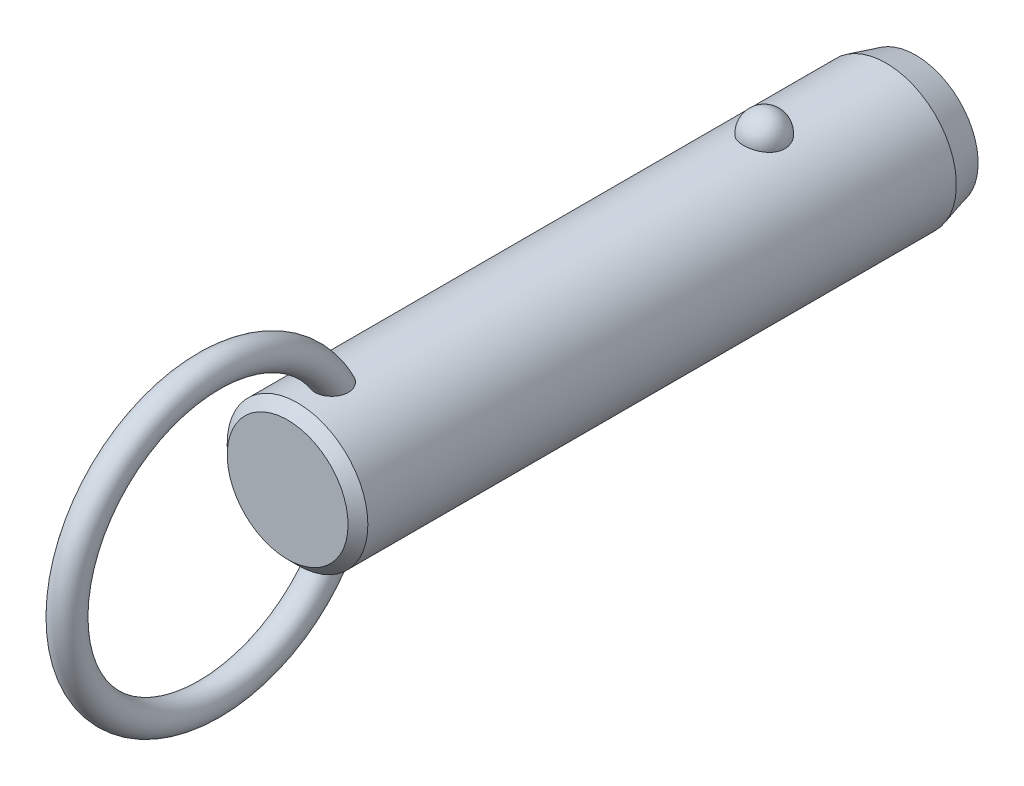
ISO-10303-21;
HEADER;
FILE_DESCRIPTION(('STEP AP214'),'2;1');
FILE_NAME('part.step','',(''),(''),'','','');
FILE_SCHEMA(('AUTOMOTIVE_DESIGN { 1 0 10303 214 1 1 1 1 }'));
ENDSEC;
DATA;
#1=APPLICATION_CONTEXT('core data for automotive mechanical design processes');
#2=APPLICATION_PROTOCOL_DEFINITION('international standard','automotive_design',2000,#1);
#3=PRODUCT_CONTEXT('',#1,'mechanical');
#4=PRODUCT('Part','Part','',(#3));
#5=PRODUCT_RELATED_PRODUCT_CATEGORY('part','',(#4));
#6=PRODUCT_DEFINITION_FORMATION('','',#4);
#7=PRODUCT_DEFINITION_CONTEXT('part definition',#1,'design');
#8=PRODUCT_DEFINITION('design','',#6,#7);
#9=PRODUCT_DEFINITION_SHAPE('','',#8);
#10=(LENGTH_UNIT() NAMED_UNIT(*) SI_UNIT(.MILLI.,.METRE.));
#11=(NAMED_UNIT(*) PLANE_ANGLE_UNIT() SI_UNIT($,.RADIAN.));
#12=(NAMED_UNIT(*) SI_UNIT($,.STERADIAN.) SOLID_ANGLE_UNIT());
#13=UNCERTAINTY_MEASURE_WITH_UNIT(LENGTH_MEASURE(1.E-05),#10,'distance_accuracy_value','');
#14=(GEOMETRIC_REPRESENTATION_CONTEXT(3) GLOBAL_UNCERTAINTY_ASSIGNED_CONTEXT((#13)) GLOBAL_UNIT_ASSIGNED_CONTEXT((#10,
#11,#12)) REPRESENTATION_CONTEXT('',''));
#15=CARTESIAN_POINT('',(0.,0.,0.));
#16=DIRECTION('',(0.,0.,1.));
#17=DIRECTION('',(1.,0.,0.));
#18=AXIS2_PLACEMENT_3D('',#15,#16,#17);
#19=CARTESIAN_POINT('',(0.,0.,38.1));
#20=DIRECTION('',(0.,0.,-1.));
#21=DIRECTION('',(-1.,0.,0.));
#22=AXIS2_PLACEMENT_3D('',#19,#20,#21);
#23=CYLINDRICAL_SURFACE('',#22,7.1);
#24=CARTESIAN_POINT('',(2.0769088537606,6.78943661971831,-2.1));
#25=CARTESIAN_POINT('',(2.07690739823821,6.78943796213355,-1.98268154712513));
#26=CARTESIAN_POINT('',(2.06738130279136,6.79237331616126,-1.86534506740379));
#27=CARTESIAN_POINT('',(2.0295040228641,6.8037853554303,-1.63400788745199));
#28=CARTESIAN_POINT('',(2.00114757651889,6.81226358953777,-1.52000812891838));
#29=CARTESIAN_POINT('',(1.92632025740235,6.83379798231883,-1.29863433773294));
#30=CARTESIAN_POINT('',(1.87985726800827,6.84685214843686,-1.19125744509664));
#31=CARTESIAN_POINT('',(1.76995205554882,6.87608091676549,-0.986046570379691));
#32=CARTESIAN_POINT('',(1.70650980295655,6.8922555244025,-0.888212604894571));
#33=CARTESIAN_POINT('',(1.56381192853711,6.92602930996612,-0.704242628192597));
#34=CARTESIAN_POINT('',(1.4844714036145,6.94363582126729,-0.618173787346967));
#35=CARTESIAN_POINT('',(1.31221746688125,6.97823658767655,-0.460740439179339));
#36=CARTESIAN_POINT('',(1.21930409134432,6.99523084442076,-0.389375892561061));
#37=CARTESIAN_POINT('',(1.02268781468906,7.02666176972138,-0.263547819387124));
#38=CARTESIAN_POINT('',(0.919020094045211,7.04110638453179,-0.209031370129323));
#39=CARTESIAN_POINT('',(0.703548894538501,7.06588726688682,-0.118163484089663));
#40=CARTESIAN_POINT('',(0.591746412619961,7.07622403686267,-0.081809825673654));
#41=CARTESIAN_POINT('',(0.365557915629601,7.09147068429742,-0.0288711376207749));
#42=CARTESIAN_POINT('',(0.251267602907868,7.09648447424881,-0.0119070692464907));
#43=CARTESIAN_POINT('',(0.0213499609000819,7.10089837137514,0.00304925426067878));
#44=CARTESIAN_POINT('',(-0.0942772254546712,7.10029907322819,0.00104351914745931));
#45=CARTESIAN_POINT('',(-0.321651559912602,7.09360829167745,-0.0216931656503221));
#46=CARTESIAN_POINT('',(-0.433431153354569,7.08760388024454,-0.0421272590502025));
#47=CARTESIAN_POINT('',(-0.651862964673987,7.07086131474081,-0.100729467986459));
#48=CARTESIAN_POINT('',(-0.758515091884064,7.06012307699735,-0.138897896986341));
#49=CARTESIAN_POINT('',(-0.96444924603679,7.03496097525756,-0.232213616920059));
#50=CARTESIAN_POINT('',(-1.06368095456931,7.02051445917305,-0.287465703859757));
#51=CARTESIAN_POINT('',(-1.25145353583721,6.98948740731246,-0.413383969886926));
#52=CARTESIAN_POINT('',(-1.33999321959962,6.97290663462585,-0.48405186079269));
#53=CARTESIAN_POINT('',(-1.50591604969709,6.93898770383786,-0.640594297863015));
#54=CARTESIAN_POINT('',(-1.58302488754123,6.92164094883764,-0.72675782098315));
#55=CARTESIAN_POINT('',(-1.72189320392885,6.8884103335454,-0.910927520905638));
#56=CARTESIAN_POINT('',(-1.78365144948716,6.87252659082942,-1.008934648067));
#57=CARTESIAN_POINT('',(-1.89101272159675,6.84377189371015,-1.21549497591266));
#58=CARTESIAN_POINT('',(-1.93639553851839,6.83094274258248,-1.32416860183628));
#59=CARTESIAN_POINT('',(-2.00874275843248,6.81002070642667,-1.54791500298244));
#60=CARTESIAN_POINT('',(-2.03570774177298,6.80192767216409,-1.66298757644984));
#61=CARTESIAN_POINT('',(-2.07047276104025,6.7914266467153,-1.89571453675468));
#62=CARTESIAN_POINT('',(-2.07835878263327,6.78899315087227,-2.01335491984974));
#63=CARTESIAN_POINT('',(-2.07502083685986,6.79001409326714,-2.24833570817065));
#64=CARTESIAN_POINT('',(-2.06379746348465,6.7934683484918,-2.36567612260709));
#65=CARTESIAN_POINT('',(-2.02263913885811,6.80583442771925,-2.59603194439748));
#66=CARTESIAN_POINT('',(-1.99281127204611,6.81471501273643,-2.70906820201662));
#67=CARTESIAN_POINT('',(-1.91526639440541,6.83691232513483,-2.92836575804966));
#68=CARTESIAN_POINT('',(-1.8675486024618,6.85022924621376,-3.03462676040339));
#69=CARTESIAN_POINT('',(-1.75504492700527,6.87991336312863,-3.23806487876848));
#70=CARTESIAN_POINT('',(-1.69015924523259,6.89629822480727,-3.33518422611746));
#71=CARTESIAN_POINT('',(-1.54505404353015,6.93024852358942,-3.51697105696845));
#72=CARTESIAN_POINT('',(-1.46483385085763,6.94781401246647,-3.60163799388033));
#73=CARTESIAN_POINT('',(-1.29071406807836,6.98225977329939,-3.75654119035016));
#74=CARTESIAN_POINT('',(-1.19675650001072,6.99913673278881,-3.82671308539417));
#75=CARTESIAN_POINT('',(-0.997940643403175,7.03023618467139,-3.9501837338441));
#76=CARTESIAN_POINT('',(-0.893083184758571,7.04445887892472,-4.00348377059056));
#77=CARTESIAN_POINT('',(-0.676902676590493,7.06848365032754,-4.09107242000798));
#78=CARTESIAN_POINT('',(-0.565686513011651,7.0783430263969,-4.12560889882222));
#79=CARTESIAN_POINT('',(-0.33873982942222,7.09282534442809,-4.17575450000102));
#80=CARTESIAN_POINT('',(-0.223009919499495,7.09744899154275,-4.19136617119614));
#81=CARTESIAN_POINT('',(0.00707628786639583,7.10090930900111,-4.20307965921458));
#82=CARTESIAN_POINT('',(0.121410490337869,7.09986531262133,-4.19958377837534));
#83=CARTESIAN_POINT('',(0.347815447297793,7.092380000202,-4.17411564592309));
#84=CARTESIAN_POINT('',(0.459886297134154,7.08593891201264,-4.15214417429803));
#85=CARTESIAN_POINT('',(0.678084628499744,7.06838983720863,-4.09049562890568));
#86=CARTESIAN_POINT('',(0.784237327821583,7.05730369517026,-4.05090137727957));
#87=CARTESIAN_POINT('',(0.988305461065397,7.03163139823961,-3.95511447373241));
#88=CARTESIAN_POINT('',(1.08622031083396,7.01704499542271,-3.89892064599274));
#89=CARTESIAN_POINT('',(1.27284490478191,6.98562668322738,-3.77035541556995));
#90=CARTESIAN_POINT('',(1.36137372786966,6.96876135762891,-3.69772964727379));
#91=CARTESIAN_POINT('',(1.52509486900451,6.93477412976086,-3.53878279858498));
#92=CARTESIAN_POINT('',(1.60028496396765,6.91765218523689,-3.45245943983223));
#93=CARTESIAN_POINT('',(1.73681688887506,6.88465753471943,-3.26658774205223));
#94=CARTESIAN_POINT('',(1.79785966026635,6.86881574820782,-3.16681408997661));
#95=CARTESIAN_POINT('',(1.90265327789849,6.84053157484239,-2.95814408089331));
#96=CARTESIAN_POINT('',(1.94640861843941,6.82808830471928,-2.84925010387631));
#97=CARTESIAN_POINT('',(2.01274378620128,6.80881460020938,-2.63454318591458));
#98=CARTESIAN_POINT('',(2.03676193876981,6.80160856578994,-2.52920574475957));
#99=CARTESIAN_POINT('',(2.06884490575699,6.79191902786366,-2.3159172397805));
#100=CARTESIAN_POINT('',(2.07691019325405,6.78943538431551,-2.20796625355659));
#101=CARTESIAN_POINT('',(2.0769088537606,6.78943661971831,-2.1));
#102=B_SPLINE_CURVE_WITH_KNOTS('',3,(#24,#25,#26,#27,#28,#29,#30,#31,#32,#33,#34,#35,#36,#37,
#38,#39,#40,#41,#42,#43,#44,#45,#46,#47,#48,#49,#50,#51,#52,#53,#54,#55,#56,#57,#58,#59,#60,#61,
#62,#63,#64,#65,#66,#67,#68,#69,#70,#71,#72,#73,#74,#75,#76,#77,#78,#79,#80,#81,#82,#83,#84,#85,
#86,#87,#88,#89,#90,#91,#92,#93,#94,#95,#96,#97,#98,#99,#100,#101),.UNSPECIFIED.,.T.,.F.,(4,2,2,
2,2,2,2,2,2,2,2,2,2,2,2,2,2,2,2,2,2,2,2,2,2,2,2,2,2,2,2,2,2,2,2,2,2,2,4),(0.,0.351568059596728,
0.703234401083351,1.05474780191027,1.40626181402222,1.75970563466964,2.11314851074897,
2.4654696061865,2.81774759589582,3.16301449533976,3.50824481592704,3.84801136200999,
4.18778391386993,4.52968352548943,4.87162112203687,5.22076181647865,5.56993054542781,
5.92363364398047,6.27732559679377,6.62942052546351,6.98150450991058,7.33158042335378,
7.68167162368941,8.03384443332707,8.38603269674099,8.73975272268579,9.09344583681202,
9.44234545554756,9.79119807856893,10.1327344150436,10.4742563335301,10.8141898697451,
11.1541474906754,11.4997793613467,11.8454687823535,12.1979079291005,12.5502553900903,
12.8738073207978,13.1973496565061),.UNSPECIFIED.);
#103=CARTESIAN_POINT('',(2.0769088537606,6.78943661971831,-2.1));
#104=VERTEX_POINT('',#103);
#105=EDGE_CURVE('E41',#104,#104,#102,.T.);
#106=ORIENTED_EDGE('',*,*,#105,.T.);
#107=EDGE_LOOP('',(#106));
#108=FACE_BOUND('',#107,.T.);
#109=CARTESIAN_POINT('',(0.,0.,45.02));
#110=DIRECTION('',(0.,0.,1.));
#111=DIRECTION('',(1.,0.,0.));
#112=AXIS2_PLACEMENT_3D('',#109,#110,#111);
#113=CIRCLE('',#112,7.1);
#114=CARTESIAN_POINT('',(7.1,0.,45.02));
#115=VERTEX_POINT('',#114);
#116=EDGE_CURVE('E10',#115,#115,#113,.F.);
#117=ORIENTED_EDGE('',*,*,#116,.T.);
#118=EDGE_LOOP('',(#117));
#119=FACE_BOUND('',#118,.T.);
#120=CARTESIAN_POINT('',(-0.429539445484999,-7.08699541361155,39.8429212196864));
#121=CARTESIAN_POINT('',(-0.50833166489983,-7.08221999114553,39.8668764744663));
#122=CARTESIAN_POINT('',(-0.585039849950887,-7.07624016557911,39.8974570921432));
#123=CARTESIAN_POINT('',(-0.732082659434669,-7.06254296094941,39.9710242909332));
#124=CARTESIAN_POINT('',(-0.802417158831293,-7.05482554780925,40.0140111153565));
#125=CARTESIAN_POINT('',(-0.934722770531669,-7.03851844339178,40.1111135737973));
#126=CARTESIAN_POINT('',(-0.996700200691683,-7.02992941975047,40.1652207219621));
#127=CARTESIAN_POINT('',(-1.11079942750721,-7.01280697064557,40.2829676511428));
#128=CARTESIAN_POINT('',(-1.16292136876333,-7.00427354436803,40.3466072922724));
#129=CARTESIAN_POINT('',(-1.25705660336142,-6.98799959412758,40.4826870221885));
#130=CARTESIAN_POINT('',(-1.29888032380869,-6.98027525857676,40.5552598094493));
#131=CARTESIAN_POINT('',(-1.37069920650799,-6.96652886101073,40.7061686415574));
#132=CARTESIAN_POINT('',(-1.40069157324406,-6.96050720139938,40.7845060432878));
#133=CARTESIAN_POINT('',(-1.45043507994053,-6.95031881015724,40.9501903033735));
#134=CARTESIAN_POINT('',(-1.46937115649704,-6.94630231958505,41.0377897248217));
#135=CARTESIAN_POINT('',(-1.49424917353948,-6.94099239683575,41.2148714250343));
#136=CARTESIAN_POINT('',(-1.50018601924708,-6.93970003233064,41.3043544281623));
#137=CARTESIAN_POINT('',(-1.49978214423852,-6.93978815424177,41.4940607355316));
#138=CARTESIAN_POINT('',(-1.49187639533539,-6.94150934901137,41.594279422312));
#139=CARTESIAN_POINT('',(-1.46177925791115,-6.94790814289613,41.7924798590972));
#140=CARTESIAN_POINT('',(-1.43957541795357,-6.95258831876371,41.890459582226));
#141=CARTESIAN_POINT('',(-1.37783293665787,-6.96510647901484,42.0953629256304));
#142=CARTESIAN_POINT('',(-1.33634073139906,-6.97328848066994,42.2016801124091));
#143=CARTESIAN_POINT('',(-1.23686994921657,-6.99161706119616,42.4061777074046));
#144=CARTESIAN_POINT('',(-1.17889192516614,-7.00176357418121,42.5043583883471));
#145=CARTESIAN_POINT('',(-1.05875124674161,-7.02082898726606,42.672374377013));
#146=CARTESIAN_POINT('',(-0.999247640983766,-7.02963746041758,42.7441230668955));
#147=CARTESIAN_POINT('',(-0.869494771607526,-7.04686074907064,42.8771959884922));
#148=CARTESIAN_POINT('',(-0.799263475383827,-7.05527619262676,42.9385372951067));
#149=CARTESIAN_POINT('',(-0.665408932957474,-7.06899457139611,43.0351316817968));
#150=CARTESIAN_POINT('',(-0.603817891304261,-7.07457275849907,43.0731512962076));
#151=CARTESIAN_POINT('',(-0.475172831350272,-7.08437420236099,43.1387581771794));
#152=CARTESIAN_POINT('',(-0.408123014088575,-7.08859848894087,43.1663533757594));
#153=CARTESIAN_POINT('',(-0.269431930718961,-7.09522749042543,43.2092569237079));
#154=CARTESIAN_POINT('',(-0.197757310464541,-7.09761688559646,43.2244618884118));
#155=CARTESIAN_POINT('',(-0.0527849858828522,-7.10017268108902,43.2407168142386));
#156=CARTESIAN_POINT('',(0.0205115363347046,-7.10034065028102,43.2417767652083));
#157=CARTESIAN_POINT('',(0.156426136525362,-7.09855986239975,43.2304619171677));
#158=CARTESIAN_POINT('',(0.219199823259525,-7.09688191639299,43.2198060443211));
#159=CARTESIAN_POINT('',(0.342134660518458,-7.09201880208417,43.1885379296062));
#160=CARTESIAN_POINT('',(0.402295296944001,-7.08883333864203,43.1679237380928));
#161=CARTESIAN_POINT('',(0.520687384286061,-7.08113868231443,43.1172125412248));
#162=CARTESIAN_POINT('',(0.57879126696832,-7.07658958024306,43.0868272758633));
#163=CARTESIAN_POINT('',(0.690173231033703,-7.06659708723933,43.0183678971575));
#164=CARTESIAN_POINT('',(0.743447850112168,-7.061153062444,42.9802883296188));
#165=CARTESIAN_POINT('',(0.870947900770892,-7.04680292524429,42.8765929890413));
#166=CARTESIAN_POINT('',(0.941828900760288,-7.0375580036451,42.8068972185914));
#167=CARTESIAN_POINT('',(1.07136606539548,-7.01900793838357,42.6569450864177));
#168=CARTESIAN_POINT('',(1.13000013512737,-7.00970271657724,42.5766700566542));
#169=CARTESIAN_POINT('',(1.23579584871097,-6.99183327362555,42.4068997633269));
#170=CARTESIAN_POINT('',(1.28274271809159,-6.98328455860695,42.3172696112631));
#171=CARTESIAN_POINT('',(1.36351442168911,-6.96796352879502,42.1321763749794));
#172=CARTESIAN_POINT('',(1.39733971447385,-6.96119115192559,42.0367134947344));
#173=CARTESIAN_POINT('',(1.45579181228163,-6.94922464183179,41.8253092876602));
#174=CARTESIAN_POINT('',(1.47790145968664,-6.94449000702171,41.708631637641));
#175=CARTESIAN_POINT('',(1.50168752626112,-6.93938731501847,41.4730153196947));
#176=CARTESIAN_POINT('',(1.50336085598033,-6.93901991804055,41.3540763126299));
#177=CARTESIAN_POINT('',(1.48486516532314,-6.9430010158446,41.1236079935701));
#178=CARTESIAN_POINT('',(1.46573441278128,-6.9471253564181,41.0119958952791));
#179=CARTESIAN_POINT('',(1.40606892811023,-6.95944667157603,40.7948868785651));
#180=CARTESIAN_POINT('',(1.3655644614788,-6.96763788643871,40.6893815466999));
#181=CARTESIAN_POINT('',(1.27082700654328,-6.98548038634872,40.5042879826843));
#182=CARTESIAN_POINT('',(1.21949810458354,-6.99473841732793,40.4231719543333));
#183=CARTESIAN_POINT('',(1.10242050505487,-7.01414069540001,40.2722278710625));
#184=CARTESIAN_POINT('',(1.03668119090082,-7.02428436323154,40.2023925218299));
#185=CARTESIAN_POINT('',(0.900559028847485,-7.04295285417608,40.0835735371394));
#186=CARTESIAN_POINT('',(0.831428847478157,-7.05153466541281,40.0331573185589));
#187=CARTESIAN_POINT('',(0.685291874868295,-7.06723150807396,39.9451429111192));
#188=CARTESIAN_POINT('',(0.608287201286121,-7.0743469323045,39.9075412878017));
#189=CARTESIAN_POINT('',(0.451878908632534,-7.08602232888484,39.8474915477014));
#190=CARTESIAN_POINT('',(0.372686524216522,-7.09067127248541,39.8245088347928));
#191=CARTESIAN_POINT('',(0.211477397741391,-7.09730788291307,39.7920357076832));
#192=CARTESIAN_POINT('',(0.129460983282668,-7.09929585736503,39.7825437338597));
#193=CARTESIAN_POINT('',(-0.0332905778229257,-7.10037858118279,39.7773517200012));
#194=CARTESIAN_POINT('',(-0.114016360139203,-7.09953334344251,39.7813656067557));
#195=CARTESIAN_POINT('',(-0.273670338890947,-7.09517338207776,39.8024540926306));
#196=CARTESIAN_POINT('',(-0.352598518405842,-7.09165863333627,39.8195288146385));
#197=CARTESIAN_POINT('',(-0.429539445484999,-7.08699541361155,39.8429212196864));
#198=B_SPLINE_CURVE_WITH_KNOTS('',3,(#120,#121,#122,#123,#124,#125,#126,#127,#128,#129,#130,
#131,#132,#133,#134,#135,#136,#137,#138,#139,#140,#141,#142,#143,#144,#145,#146,#147,#148,#149,
#150,#151,#152,#153,#154,#155,#156,#157,#158,#159,#160,#161,#162,#163,#164,#165,#166,#167,#168,
#169,#170,#171,#172,#173,#174,#175,#176,#177,#178,#179,#180,#181,#182,#183,#184,#185,#186,#187,
#188,#189,#190,#191,#192,#193,#194,#195,#196,#197),.UNSPECIFIED.,.T.,.F.,(4,2,2,2,2,2,2,2,2,2,2,
2,2,2,2,2,2,2,2,2,2,2,2,2,2,2,2,2,2,2,2,2,2,2,2,2,2,2,4),(0.,0.247183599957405,
0.494372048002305,0.741372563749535,0.988369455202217,1.23962059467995,1.49093106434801,
1.75897818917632,2.02713035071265,2.32758265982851,2.62829697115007,2.9700873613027,
3.31186629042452,3.59175319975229,3.87117637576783,4.08813841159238,4.30493502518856,
4.52352259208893,4.74195577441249,4.93215328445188,5.12238804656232,5.31884850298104,
5.51544871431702,5.81332317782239,6.11173048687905,6.41527266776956,6.71880423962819,
7.07358156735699,7.42841252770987,7.7663148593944,8.10373999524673,8.39142246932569,
8.67891817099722,8.93560332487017,9.19221962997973,9.43881106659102,9.68537399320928,
9.92674752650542,10.1681233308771),.UNSPECIFIED.);
#199=CARTESIAN_POINT('',(-0.429539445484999,-7.08699541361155,39.8429212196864));
#200=VERTEX_POINT('',#199);
#201=EDGE_CURVE('E59',#200,#200,#198,.T.);
#202=ORIENTED_EDGE('',*,*,#201,.T.);
#203=EDGE_LOOP('',(#202));
#204=FACE_BOUND('',#203,.T.);
#205=CARTESIAN_POINT('',(-0.429539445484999,7.08699541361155,39.8429212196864));
#206=CARTESIAN_POINT('',(-0.351665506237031,7.09171429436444,39.8192469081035));
#207=CARTESIAN_POINT('',(-0.271733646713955,7.09525896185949,39.8020369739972));
#208=CARTESIAN_POINT('',(-0.110026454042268,7.09960839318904,39.7810059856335));
#209=CARTESIAN_POINT('',(-0.0282502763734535,7.10041187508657,39.777191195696));
#210=CARTESIAN_POINT('',(0.134782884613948,7.09918849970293,39.783059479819));
#211=CARTESIAN_POINT('',(0.216039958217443,7.09716214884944,39.7927401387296));
#212=CARTESIAN_POINT('',(0.375730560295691,7.09050177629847,39.8253471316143));
#213=CARTESIAN_POINT('',(0.454164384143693,7.08586802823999,39.8482720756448));
#214=CARTESIAN_POINT('',(0.606025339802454,7.07449911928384,39.906771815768));
#215=CARTESIAN_POINT('',(0.679451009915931,7.06776334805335,39.9423502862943));
#216=CARTESIAN_POINT('',(0.819234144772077,7.05292866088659,40.0251753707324));
#217=CARTESIAN_POINT('',(0.88559181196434,7.04482978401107,40.0724216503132));
#218=CARTESIAN_POINT('',(1.00993211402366,7.02808709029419,40.1775902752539));
#219=CARTESIAN_POINT('',(1.06785399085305,7.01943990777,40.235583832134));
#220=CARTESIAN_POINT('',(1.17342527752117,7.00256662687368,40.3603013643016));
#221=CARTESIAN_POINT('',(1.22107408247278,6.99434055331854,40.4270258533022));
#222=CARTESIAN_POINT('',(1.30652927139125,6.97889183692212,40.5693622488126));
#223=CARTESIAN_POINT('',(1.34399711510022,6.97170674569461,40.6451808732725));
#224=CARTESIAN_POINT('',(1.40682616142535,6.95930080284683,40.8018100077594));
#225=CARTESIAN_POINT('',(1.43218374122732,6.95408053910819,40.8826220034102));
#226=CARTESIAN_POINT('',(1.47246409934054,6.94566853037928,41.0535314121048));
#227=CARTESIAN_POINT('',(1.48642590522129,6.9426653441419,41.1438630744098));
#228=CARTESIAN_POINT('',(1.5011410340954,6.93949744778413,41.325619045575));
#229=CARTESIAN_POINT('',(1.50188917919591,6.93933385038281,41.4170437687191));
#230=CARTESIAN_POINT('',(1.49030464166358,6.94183245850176,41.6108438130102));
#231=CARTESIAN_POINT('',(1.47627413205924,6.94486147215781,41.713112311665));
#232=CARTESIAN_POINT('',(1.43356351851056,6.95380194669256,41.9144719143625));
#233=CARTESIAN_POINT('',(1.4048676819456,6.95971650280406,42.0135594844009));
#234=CARTESIAN_POINT('',(1.32908750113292,6.97461208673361,42.2189087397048));
#235=CARTESIAN_POINT('',(1.28011435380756,6.98388945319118,42.3244566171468));
#236=CARTESIAN_POINT('',(1.16520357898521,7.00397743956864,42.5257604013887));
#237=CARTESIAN_POINT('',(1.09927694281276,7.01478706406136,42.6215225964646));
#238=CARTESIAN_POINT('',(0.969361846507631,7.03373936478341,42.7767565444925));
#239=CARTESIAN_POINT('',(0.909042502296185,7.04187023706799,42.8393032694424));
#240=CARTESIAN_POINT('',(0.779178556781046,7.05741732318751,42.9540535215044));
#241=CARTESIAN_POINT('',(0.709649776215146,7.06483472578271,43.0062744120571));
#242=CARTESIAN_POINT('',(0.576854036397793,7.0767751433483,43.0881138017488));
#243=CARTESIAN_POINT('',(0.515118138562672,7.08158033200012,43.1201641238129));
#244=CARTESIAN_POINT('',(0.387127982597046,7.08972701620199,43.1737656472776));
#245=CARTESIAN_POINT('',(0.320877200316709,7.09306962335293,43.1953248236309));
#246=CARTESIAN_POINT('',(0.185041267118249,7.09791507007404,43.2264005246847));
#247=CARTESIAN_POINT('',(0.115437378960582,7.09940591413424,43.2358385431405));
#248=CARTESIAN_POINT('',(-0.0243157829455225,7.10030171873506,43.2415226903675));
#249=CARTESIAN_POINT('',(-0.0944648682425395,7.0997073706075,43.2377731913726));
#250=CARTESIAN_POINT('',(-0.225713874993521,7.09668414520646,43.2185081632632));
#251=CARTESIAN_POINT('',(-0.287006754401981,7.09444865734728,43.2042323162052));
#252=CARTESIAN_POINT('',(-0.406555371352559,7.08860360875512,43.1663685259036));
#253=CARTESIAN_POINT('',(-0.464809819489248,7.08499346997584,43.1427766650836));
#254=CARTESIAN_POINT('',(-0.594955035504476,7.07541654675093,43.0789232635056));
#255=CARTESIAN_POINT('',(-0.665389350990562,7.06906574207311,43.035753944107));
#256=CARTESIAN_POINT('',(-0.798242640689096,7.05530261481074,42.938587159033));
#257=CARTESIAN_POINT('',(-0.86064561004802,7.0478882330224,42.8845686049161));
#258=CARTESIAN_POINT('',(-0.994249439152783,7.03045217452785,42.7509965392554));
#259=CARTESIAN_POINT('',(-1.06260129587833,7.02030745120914,42.6686143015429));
#260=CARTESIAN_POINT('',(-1.18502045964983,7.00068382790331,42.493843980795));
#261=CARTESIAN_POINT('',(-1.23907684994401,6.99120544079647,42.401448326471));
#262=CARTESIAN_POINT('',(-1.33335589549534,6.97384343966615,42.2080085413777));
#263=CARTESIAN_POINT('',(-1.3733613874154,6.96598557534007,42.1068564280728));
#264=CARTESIAN_POINT('',(-1.43770677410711,6.9529905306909,41.8995046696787));
#265=CARTESIAN_POINT('',(-1.46204473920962,6.94785368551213,41.79330440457));
#266=CARTESIAN_POINT('',(-1.49537533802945,6.94076296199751,41.568231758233));
#267=CARTESIAN_POINT('',(-1.50273564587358,6.93914842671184,41.4490975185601));
#268=CARTESIAN_POINT('',(-1.4954555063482,6.94072368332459,41.2114703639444));
#269=CARTESIAN_POINT('',(-1.48082914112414,6.94391040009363,41.0929770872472));
#270=CARTESIAN_POINT('',(-1.43076401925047,6.95438579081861,40.8734325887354));
#271=CARTESIAN_POINT('',(-1.39762227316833,6.96121852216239,40.7718413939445));
#272=CARTESIAN_POINT('',(-1.31211274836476,6.97783941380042,40.5773513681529));
#273=CARTESIAN_POINT('',(-1.25976607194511,6.98762432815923,40.4844431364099));
#274=CARTESIAN_POINT('',(-1.14583073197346,7.00713153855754,40.3241601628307));
#275=CARTESIAN_POINT('',(-1.0866594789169,7.01665982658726,40.2550351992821));
#276=CARTESIAN_POINT('',(-0.956606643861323,7.03556646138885,40.1288786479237));
#277=CARTESIAN_POINT('',(-0.885737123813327,7.04494495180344,40.0718347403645));
#278=CARTESIAN_POINT('',(-0.751558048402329,7.06035735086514,39.9831004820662));
#279=CARTESIAN_POINT('',(-0.690120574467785,7.0666695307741,39.9485932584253));
#280=CARTESIAN_POINT('',(-0.562815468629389,7.07794609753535,39.8887507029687));
#281=CARTESIAN_POINT('',(-0.496948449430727,7.08291067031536,39.8634141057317));
#282=CARTESIAN_POINT('',(-0.429539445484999,7.08699541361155,39.8429212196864));
#283=B_SPLINE_CURVE_WITH_KNOTS('',3,(#205,#206,#207,#208,#209,#210,#211,#212,#213,#214,#215,
#216,#217,#218,#219,#220,#221,#222,#223,#224,#225,#226,#227,#228,#229,#230,#231,#232,#233,#234,
#235,#236,#237,#238,#239,#240,#241,#242,#243,#244,#245,#246,#247,#248,#249,#250,#251,#252,#253,
#254,#255,#256,#257,#258,#259,#260,#261,#262,#263,#264,#265,#266,#267,#268,#269,#270,#271,#272,
#273,#274,#275,#276,#277,#278,#279,#280,#281,#282),.UNSPECIFIED.,.T.,.F.,(4,2,2,2,2,2,2,2,2,2,2,
2,2,2,2,2,2,2,2,2,2,2,2,2,2,2,2,2,2,2,2,2,2,2,2,2,2,2,4),(0.,0.244335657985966,
0.488785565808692,0.733191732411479,0.977572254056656,1.22202379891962,1.46646834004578,
1.71259457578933,1.9587352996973,2.21226768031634,2.46587585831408,2.7391381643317,
3.01250754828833,3.32109936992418,3.63002293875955,3.97863512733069,4.32702187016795,
4.58793945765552,4.84841449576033,5.05676704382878,5.26496096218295,5.47449661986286,
5.68396281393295,5.8720544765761,6.06022532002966,6.30743751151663,6.55513496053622,
6.87602468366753,7.19715875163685,7.52305774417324,7.84899686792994,8.20516155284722,
8.5610982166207,8.88040084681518,9.19935367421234,9.47236282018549,9.74509220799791,
9.95662250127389,10.1681235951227),.UNSPECIFIED.);
#284=CARTESIAN_POINT('',(-0.429539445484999,7.08699541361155,39.8429212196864));
#285=VERTEX_POINT('',#284);
#286=EDGE_CURVE('E67',#285,#285,#283,.T.);
#287=ORIENTED_EDGE('',*,*,#286,.T.);
#288=EDGE_LOOP('',(#287));
#289=FACE_BOUND('',#288,.T.);
#290=CARTESIAN_POINT('',(0.,0.,-14.4));
#291=DIRECTION('',(0.,0.,-1.));
#292=DIRECTION('',(-1.,0.,0.));
#293=AXIS2_PLACEMENT_3D('',#290,#291,#292);
#294=CIRCLE('',#293,7.1);
#295=CARTESIAN_POINT('',(-7.1,0.,-14.4));
#296=VERTEX_POINT('',#295);
#297=EDGE_CURVE('E56',#296,#296,#294,.F.);
#298=ORIENTED_EDGE('',*,*,#297,.T.);
#299=EDGE_LOOP('',(#298));
#300=FACE_BOUND('',#299,.T.);
#301=ADVANCED_FACE('F37',(#108,#119,#204,#289,#300),#23,.T.);
#302=CARTESIAN_POINT('',(0.,0.,-17.4));
#303=DIRECTION('',(0.,0.,-1.));
#304=DIRECTION('',(-1.,0.,0.));
#305=AXIS2_PLACEMENT_3D('',#302,#303,#304);
#306=PLANE('',#305);
#307=CARTESIAN_POINT('',(0.,0.,-17.4));
#308=DIRECTION('',(0.,0.,-1.));
#309=DIRECTION('',(-1.,0.,0.));
#310=AXIS2_PLACEMENT_3D('',#307,#308,#309);
#311=CIRCLE('',#310,6.29615242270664);
#312=CARTESIAN_POINT('',(-6.29615242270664,0.,-17.4));
#313=VERTEX_POINT('',#312);
#314=EDGE_CURVE('E66',#313,#313,#311,.T.);
#315=ORIENTED_EDGE('',*,*,#314,.T.);
#316=EDGE_LOOP('',(#315));
#317=FACE_BOUND('',#316,.T.);
#318=ADVANCED_FACE('F85',(#317),#306,.T.);
#319=CARTESIAN_POINT('',(0.,0.,-17.4));
#320=DIRECTION('',(0.,0.,1.));
#321=DIRECTION('',(1.,0.,0.));
#322=AXIS2_PLACEMENT_3D('',#319,#320,#321);
#323=CONICAL_SURFACE('',#322,6.29615242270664,0.261799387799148);
#324=ORIENTED_EDGE('',*,*,#297,.F.);
#325=EDGE_LOOP('',(#324));
#326=FACE_BOUND('',#325,.T.);
#327=ORIENTED_EDGE('',*,*,#314,.F.);
#328=EDGE_LOOP('',(#327));
#329=FACE_BOUND('',#328,.T.);
#330=ADVANCED_FACE('F83',(#326,#329),#323,.T.);
#331=CARTESIAN_POINT('',(0.,0.,46.02));
#332=DIRECTION('',(0.,0.,1.));
#333=DIRECTION('',(1.,0.,0.));
#334=AXIS2_PLACEMENT_3D('',#331,#332,#333);
#335=PLANE('',#334);
#336=CARTESIAN_POINT('',(0.,0.,46.02));
#337=DIRECTION('',(0.,0.,1.));
#338=DIRECTION('',(1.,0.,0.));
#339=AXIS2_PLACEMENT_3D('',#336,#337,#338);
#340=CIRCLE('',#339,6.10000000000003);
#341=CARTESIAN_POINT('',(6.10000000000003,0.,46.02));
#342=VERTEX_POINT('',#341);
#343=EDGE_CURVE('E50',#342,#342,#340,.T.);
#344=ORIENTED_EDGE('',*,*,#343,.T.);
#345=EDGE_LOOP('',(#344));
#346=FACE_BOUND('',#345,.T.);
#347=ADVANCED_FACE('F77',(#346),#335,.T.);
#348=CARTESIAN_POINT('',(0.,0.,53.95));
#349=DIRECTION('',(1.,0.,0.));
#350=DIRECTION('',(0.,0.,-1.));
#351=AXIS2_PLACEMENT_3D('',#348,#349,#350);
#352=TOROIDAL_SURFACE('',#351,14.35,1.5);
#353=ORIENTED_EDGE('',*,*,#286,.F.);
#354=EDGE_LOOP('',(#353));
#355=FACE_BOUND('',#354,.T.);
#356=ORIENTED_EDGE('',*,*,#201,.F.);
#357=EDGE_LOOP('',(#356));
#358=FACE_BOUND('',#357,.T.);
#359=ADVANCED_FACE('F73',(#355,#358),#352,.T.);
#360=CARTESIAN_POINT('',(0.,0.,46.02));
#361=DIRECTION('',(0.,0.,-1.));
#362=DIRECTION('',(-1.,0.,0.));
#363=AXIS2_PLACEMENT_3D('',#360,#361,#362);
#364=CONICAL_SURFACE('',#363,6.10000000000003,0.785398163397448);
#365=ORIENTED_EDGE('',*,*,#116,.F.);
#366=EDGE_LOOP('',(#365));
#367=FACE_BOUND('',#366,.T.);
#368=ORIENTED_EDGE('',*,*,#343,.F.);
#369=EDGE_LOOP('',(#368));
#370=FACE_BOUND('',#369,.T.);
#371=ADVANCED_FACE('F39',(#367,#370),#364,.T.);
#372=CARTESIAN_POINT('',(0.,7.1,-2.1));
#373=DIRECTION('',(0.,1.,0.));
#374=DIRECTION('',(0.,0.,1.));
#375=AXIS2_PLACEMENT_3D('',#372,#373,#374);
#376=SPHERICAL_SURFACE('',#375,2.10000000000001);
#377=ORIENTED_EDGE('',*,*,#105,.F.);
#378=EDGE_LOOP('',(#377));
#379=FACE_BOUND('',#378,.T.);
#380=ADVANCED_FACE('F79',(#379),#376,.T.);
#381=CLOSED_SHELL('',(#301,#318,#330,#347,#359,#371,#380));
#382=MANIFOLD_SOLID_BREP('B2',#381);
#383=ADVANCED_BREP_SHAPE_REPRESENTATION('',(#18,#382),#14);
#384=SHAPE_DEFINITION_REPRESENTATION(#9,#383);
ENDSEC;
END-ISO-10303-21;
